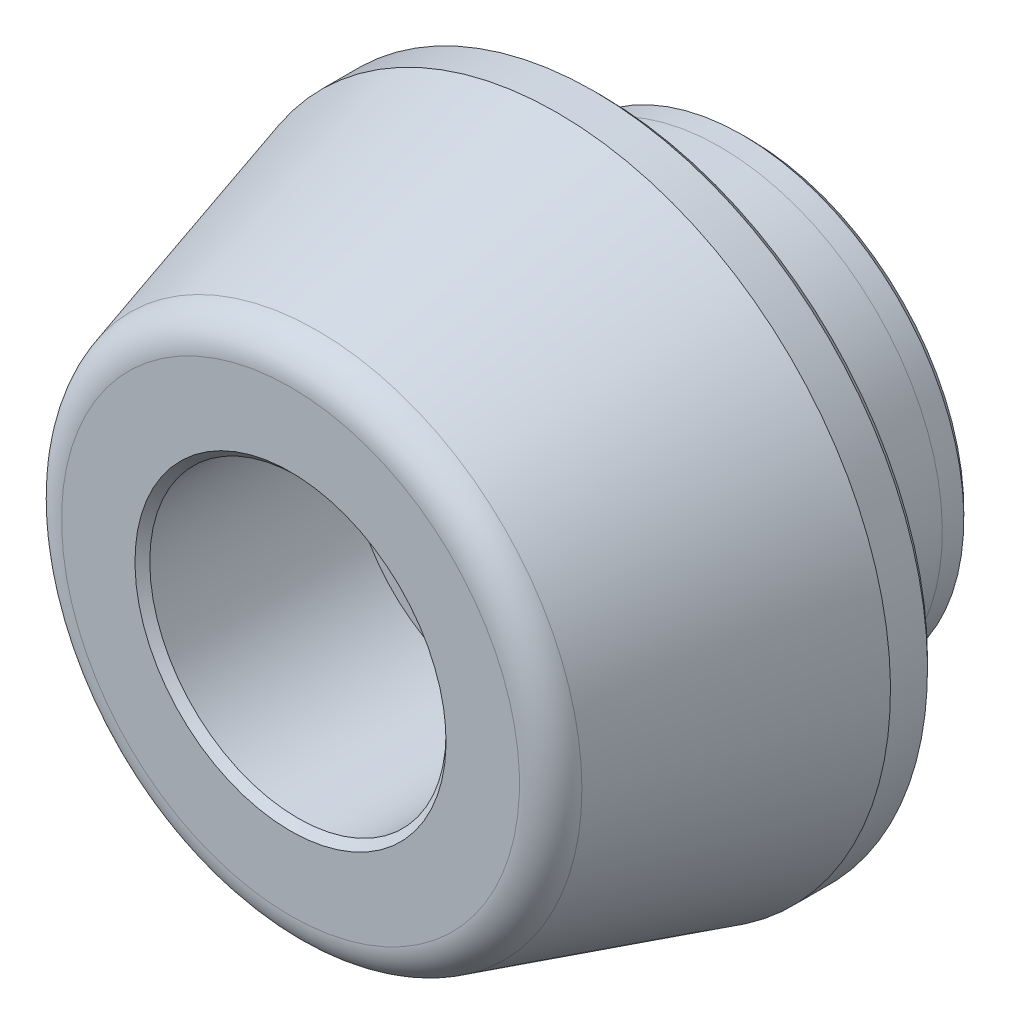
ISO-10303-21;
HEADER;
FILE_DESCRIPTION(('STEP AP214'),'2;1');
FILE_NAME('part.step','',(''),(''),'','','');
FILE_SCHEMA(('AUTOMOTIVE_DESIGN { 1 0 10303 214 1 1 1 1 }'));
ENDSEC;
DATA;
#1=APPLICATION_CONTEXT('core data for automotive mechanical design processes');
#2=APPLICATION_PROTOCOL_DEFINITION('international standard','automotive_design',2000,#1);
#3=PRODUCT_CONTEXT('',#1,'mechanical');
#4=PRODUCT('Part','Part','',(#3));
#5=PRODUCT_RELATED_PRODUCT_CATEGORY('part','',(#4));
#6=PRODUCT_DEFINITION_FORMATION('','',#4);
#7=PRODUCT_DEFINITION_CONTEXT('part definition',#1,'design');
#8=PRODUCT_DEFINITION('design','',#6,#7);
#9=PRODUCT_DEFINITION_SHAPE('','',#8);
#10=(LENGTH_UNIT() NAMED_UNIT(*) SI_UNIT(.MILLI.,.METRE.));
#11=(NAMED_UNIT(*) PLANE_ANGLE_UNIT() SI_UNIT($,.RADIAN.));
#12=(NAMED_UNIT(*) SI_UNIT($,.STERADIAN.) SOLID_ANGLE_UNIT());
#13=UNCERTAINTY_MEASURE_WITH_UNIT(LENGTH_MEASURE(1.E-05),#10,'distance_accuracy_value','');
#14=(GEOMETRIC_REPRESENTATION_CONTEXT(3) GLOBAL_UNCERTAINTY_ASSIGNED_CONTEXT((#13)) GLOBAL_UNIT_ASSIGNED_CONTEXT((#10,
#11,#12)) REPRESENTATION_CONTEXT('',''));
#15=CARTESIAN_POINT('',(0.,0.,0.));
#16=DIRECTION('',(0.,0.,1.));
#17=DIRECTION('',(1.,0.,0.));
#18=AXIS2_PLACEMENT_3D('',#15,#16,#17);
#19=CARTESIAN_POINT('',(0.,-1.08235921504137E-13,31.));
#20=DIRECTION('',(0.,0.,1.));
#21=DIRECTION('',(0.,-1.,0.));
#22=AXIS2_PLACEMENT_3D('',#19,#20,#21);
#23=CYLINDRICAL_SURFACE('',#22,7.);
#24=CARTESIAN_POINT('',(0.,0.,2.));
#25=DIRECTION('',(0.,0.,-1.));
#26=DIRECTION('',(0.,1.,0.));
#27=AXIS2_PLACEMENT_3D('',#24,#25,#26);
#28=CIRCLE('',#27,7.);
#29=CARTESIAN_POINT('',(0.,6.99999999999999,2.00000000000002));
#30=VERTEX_POINT('',#29);
#31=EDGE_CURVE('E9',#30,#30,#28,.T.);
#32=ORIENTED_EDGE('',*,*,#31,.T.);
#33=EDGE_LOOP('',(#32));
#34=FACE_BOUND('',#33,.T.);
#35=CARTESIAN_POINT('',(0.,0.,16.5));
#36=DIRECTION('',(0.,0.,1.));
#37=DIRECTION('',(0.,-1.,0.));
#38=AXIS2_PLACEMENT_3D('',#35,#36,#37);
#39=CIRCLE('',#38,7.);
#40=CARTESIAN_POINT('',(0.,-7.00000000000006,16.5));
#41=VERTEX_POINT('',#40);
#42=EDGE_CURVE('E40',#41,#41,#39,.T.);
#43=ORIENTED_EDGE('',*,*,#42,.T.);
#44=EDGE_LOOP('',(#43));
#45=FACE_BOUND('',#44,.T.);
#46=ADVANCED_FACE('F14',(#34,#45),#23,.F.);
#47=CARTESIAN_POINT('',(0.,0.,0.));
#48=DIRECTION('',(0.,0.,-1.));
#49=DIRECTION('',(0.,1.,0.));
#50=AXIS2_PLACEMENT_3D('',#47,#48,#49);
#51=CYLINDRICAL_SURFACE('',#50,15.);
#52=CARTESIAN_POINT('',(0.,0.,8.8));
#53=DIRECTION('',(0.,0.,-1.));
#54=DIRECTION('',(0.,1.,0.));
#55=AXIS2_PLACEMENT_3D('',#52,#53,#54);
#56=CIRCLE('',#55,15.);
#57=CARTESIAN_POINT('',(0.,15.,8.80000000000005));
#58=VERTEX_POINT('',#57);
#59=EDGE_CURVE('E70',#58,#58,#56,.T.);
#60=ORIENTED_EDGE('',*,*,#59,.T.);
#61=EDGE_LOOP('',(#60));
#62=FACE_BOUND('',#61,.T.);
#63=CARTESIAN_POINT('',(0.,0.,2.));
#64=DIRECTION('',(0.,0.,-1.));
#65=DIRECTION('',(0.,1.,0.));
#66=AXIS2_PLACEMENT_3D('',#63,#64,#65);
#67=CIRCLE('',#66,15.);
#68=CARTESIAN_POINT('',(0.,15.,2.00000000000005));
#69=VERTEX_POINT('',#68);
#70=EDGE_CURVE('E64',#69,#69,#67,.T.);
#71=ORIENTED_EDGE('',*,*,#70,.F.);
#72=EDGE_LOOP('',(#71));
#73=FACE_BOUND('',#72,.T.);
#74=ADVANCED_FACE('F108',(#62,#73),#51,.T.);
#75=CARTESIAN_POINT('',(0.,0.,0.));
#76=DIRECTION('',(0.,0.,-1.));
#77=DIRECTION('',(0.,1.,0.));
#78=AXIS2_PLACEMENT_3D('',#75,#76,#77);
#79=PLANE('',#78);
#80=CARTESIAN_POINT('',(0.,0.,0.));
#81=DIRECTION('',(0.,0.,-1.));
#82=DIRECTION('',(0.,1.,0.));
#83=AXIS2_PLACEMENT_3D('',#80,#81,#82);
#84=CIRCLE('',#83,9.);
#85=CARTESIAN_POINT('',(0.,9.,0.));
#86=VERTEX_POINT('',#85);
#87=EDGE_CURVE('E21',#86,#86,#84,.F.);
#88=ORIENTED_EDGE('',*,*,#87,.T.);
#89=EDGE_LOOP('',(#88));
#90=FACE_BOUND('',#89,.T.);
#91=CARTESIAN_POINT('',(0.,0.,0.));
#92=DIRECTION('',(0.,0.,-1.));
#93=DIRECTION('',(0.,1.,0.));
#94=AXIS2_PLACEMENT_3D('',#91,#92,#93);
#95=CIRCLE('',#94,14.45);
#96=CARTESIAN_POINT('',(0.,14.45,0.));
#97=VERTEX_POINT('',#96);
#98=EDGE_CURVE('E49',#97,#97,#95,.T.);
#99=ORIENTED_EDGE('',*,*,#98,.T.);
#100=EDGE_LOOP('',(#99));
#101=FACE_BOUND('',#100,.T.);
#102=ADVANCED_FACE('F114',(#90,#101),#79,.T.);
#103=CARTESIAN_POINT('',(0.,-1.08235921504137E-13,31.));
#104=DIRECTION('',(0.,0.,1.));
#105=DIRECTION('',(0.,-1.,0.));
#106=AXIS2_PLACEMENT_3D('',#103,#104,#105);
#107=PLANE('',#106);
#108=CARTESIAN_POINT('',(0.,-1.08235921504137E-13,31.));
#109=DIRECTION('',(0.,0.,1.));
#110=DIRECTION('',(0.,-1.,0.));
#111=AXIS2_PLACEMENT_3D('',#108,#109,#110);
#112=CIRCLE('',#111,10.5);
#113=CARTESIAN_POINT('',(0.,-10.5000000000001,31.));
#114=VERTEX_POINT('',#113);
#115=EDGE_CURVE('E34',#114,#114,#112,.F.);
#116=ORIENTED_EDGE('',*,*,#115,.T.);
#117=EDGE_LOOP('',(#116));
#118=FACE_BOUND('',#117,.T.);
#119=CARTESIAN_POINT('',(0.,-1.08235921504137E-13,31.));
#120=DIRECTION('',(0.,0.,1.));
#121=DIRECTION('',(0.,-1.,0.));
#122=AXIS2_PLACEMENT_3D('',#119,#120,#121);
#123=CIRCLE('',#122,15.4546979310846);
#124=CARTESIAN_POINT('',(0.,-15.4546979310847,30.9999999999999));
#125=VERTEX_POINT('',#124);
#126=EDGE_CURVE('E52',#125,#125,#123,.T.);
#127=ORIENTED_EDGE('',*,*,#126,.T.);
#128=EDGE_LOOP('',(#127));
#129=FACE_BOUND('',#128,.T.);
#130=ADVANCED_FACE('F120',(#118,#129),#107,.T.);
#131=CARTESIAN_POINT('',(0.,0.,13.));
#132=DIRECTION('',(0.,0.,-1.));
#133=DIRECTION('',(0.,1.,0.));
#134=AXIS2_PLACEMENT_3D('',#131,#132,#133);
#135=CONICAL_SURFACE('',#134,22.5,0.279252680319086);
#136=CARTESIAN_POINT('',(0.,-1.01913174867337E-13,29.1890933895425));
#137=DIRECTION('',(0.,0.,1.));
#138=DIRECTION('',(0.,-1.,0.));
#139=AXIS2_PLACEMENT_3D('',#136,#137,#138);
#140=CIRCLE('',#139,17.8578521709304);
#141=CARTESIAN_POINT('',(0.,-17.8578521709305,29.1890933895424));
#142=VERTEX_POINT('',#141);
#143=EDGE_CURVE('E55',#142,#142,#140,.F.);
#144=ORIENTED_EDGE('',*,*,#143,.T.);
#145=EDGE_LOOP('',(#144));
#146=FACE_BOUND('',#145,.T.);
#147=CARTESIAN_POINT('',(0.,0.,13.));
#148=DIRECTION('',(0.,0.,-1.));
#149=DIRECTION('',(0.,1.,0.));
#150=AXIS2_PLACEMENT_3D('',#147,#148,#149);
#151=CIRCLE('',#150,22.5);
#152=CARTESIAN_POINT('',(0.,22.5,13.0000000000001));
#153=VERTEX_POINT('',#152);
#154=EDGE_CURVE('E58',#153,#153,#151,.T.);
#155=ORIENTED_EDGE('',*,*,#154,.F.);
#156=EDGE_LOOP('',(#155));
#157=FACE_BOUND('',#156,.T.);
#158=ADVANCED_FACE('F103',(#146,#157),#135,.T.);
#159=CARTESIAN_POINT('',(0.,0.,0.));
#160=DIRECTION('',(0.,0.,-1.));
#161=DIRECTION('',(0.,1.,0.));
#162=AXIS2_PLACEMENT_3D('',#159,#160,#161);
#163=CYLINDRICAL_SURFACE('',#162,22.5);
#164=CARTESIAN_POINT('',(0.,0.,10.5));
#165=DIRECTION('',(0.,0.,-1.));
#166=DIRECTION('',(0.,1.,0.));
#167=AXIS2_PLACEMENT_3D('',#164,#165,#166);
#168=CIRCLE('',#167,22.5);
#169=CARTESIAN_POINT('',(0.,22.5,10.5000000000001));
#170=VERTEX_POINT('',#169);
#171=EDGE_CURVE('E25',#170,#170,#168,.F.);
#172=ORIENTED_EDGE('',*,*,#171,.T.);
#173=EDGE_LOOP('',(#172));
#174=FACE_BOUND('',#173,.T.);
#175=ORIENTED_EDGE('',*,*,#154,.T.);
#176=EDGE_LOOP('',(#175));
#177=FACE_BOUND('',#176,.T.);
#178=ADVANCED_FACE('F91',(#174,#177),#163,.T.);
#179=CARTESIAN_POINT('',(22.5,0.,10.));
#180=DIRECTION('',(0.,0.,-1.));
#181=DIRECTION('',(0.,1.,0.));
#182=AXIS2_PLACEMENT_3D('',#179,#180,#181);
#183=PLANE('',#182);
#184=CARTESIAN_POINT('',(0.,0.,10.));
#185=DIRECTION('',(0.,0.,-1.));
#186=DIRECTION('',(0.,1.,0.));
#187=AXIS2_PLACEMENT_3D('',#184,#185,#186);
#188=CIRCLE('',#187,22.);
#189=CARTESIAN_POINT('',(0.,22.,10.0000000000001));
#190=VERTEX_POINT('',#189);
#191=EDGE_CURVE('E29',#190,#190,#188,.T.);
#192=ORIENTED_EDGE('',*,*,#191,.T.);
#193=EDGE_LOOP('',(#192));
#194=FACE_BOUND('',#193,.T.);
#195=CARTESIAN_POINT('',(0.,0.,10.));
#196=DIRECTION('',(0.,0.,-1.));
#197=DIRECTION('',(0.,1.,0.));
#198=AXIS2_PLACEMENT_3D('',#195,#196,#197);
#199=CIRCLE('',#198,15.8);
#200=CARTESIAN_POINT('',(0.,15.8,10.0000000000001));
#201=VERTEX_POINT('',#200);
#202=EDGE_CURVE('E82',#201,#201,#199,.T.);
#203=ORIENTED_EDGE('',*,*,#202,.F.);
#204=EDGE_LOOP('',(#203));
#205=FACE_BOUND('',#204,.T.);
#206=ADVANCED_FACE('F88',(#194,#205),#183,.T.);
#207=CARTESIAN_POINT('',(0.,0.,0.));
#208=DIRECTION('',(0.,0.,-1.));
#209=DIRECTION('',(0.,1.,0.));
#210=AXIS2_PLACEMENT_3D('',#207,#208,#209);
#211=CYLINDRICAL_SURFACE('',#210,14.95);
#212=CARTESIAN_POINT('',(0.,0.,0.5));
#213=DIRECTION('',(0.,0.,-1.));
#214=DIRECTION('',(0.,1.,0.));
#215=AXIS2_PLACEMENT_3D('',#212,#213,#214);
#216=CIRCLE('',#215,14.95);
#217=CARTESIAN_POINT('',(0.,14.95,0.500000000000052));
#218=VERTEX_POINT('',#217);
#219=EDGE_CURVE('E46',#218,#218,#216,.F.);
#220=ORIENTED_EDGE('',*,*,#219,.T.);
#221=EDGE_LOOP('',(#220));
#222=FACE_BOUND('',#221,.T.);
#223=CARTESIAN_POINT('',(0.,0.,2.));
#224=DIRECTION('',(0.,0.,-1.));
#225=DIRECTION('',(0.,1.,0.));
#226=AXIS2_PLACEMENT_3D('',#223,#224,#225);
#227=CIRCLE('',#226,14.95);
#228=CARTESIAN_POINT('',(0.,14.95,2.00000000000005));
#229=VERTEX_POINT('',#228);
#230=EDGE_CURVE('E61',#229,#229,#227,.T.);
#231=ORIENTED_EDGE('',*,*,#230,.T.);
#232=EDGE_LOOP('',(#231));
#233=FACE_BOUND('',#232,.T.);
#234=ADVANCED_FACE('F90',(#222,#233),#211,.T.);
#235=CARTESIAN_POINT('',(-14.95,0.,2.));
#236=DIRECTION('',(0.,0.,-1.));
#237=DIRECTION('',(0.,1.,0.));
#238=AXIS2_PLACEMENT_3D('',#235,#236,#237);
#239=PLANE('',#238);
#240=ORIENTED_EDGE('',*,*,#70,.T.);
#241=EDGE_LOOP('',(#240));
#242=FACE_BOUND('',#241,.T.);
#243=ORIENTED_EDGE('',*,*,#230,.F.);
#244=EDGE_LOOP('',(#243));
#245=FACE_BOUND('',#244,.T.);
#246=ADVANCED_FACE('F100',(#242,#245),#239,.T.);
#247=CARTESIAN_POINT('',(0.,0.,17.));
#248=DIRECTION('',(0.,0.,1.));
#249=DIRECTION('',(0.,-1.,0.));
#250=AXIS2_PLACEMENT_3D('',#247,#248,#249);
#251=PLANE('',#250);
#252=CARTESIAN_POINT('',(0.,0.,17.));
#253=DIRECTION('',(0.,0.,1.));
#254=DIRECTION('',(0.,-1.,0.));
#255=AXIS2_PLACEMENT_3D('',#252,#253,#254);
#256=CIRCLE('',#255,7.5);
#257=CARTESIAN_POINT('',(0.,-7.50000000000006,17.));
#258=VERTEX_POINT('',#257);
#259=EDGE_CURVE('E43',#258,#258,#256,.F.);
#260=ORIENTED_EDGE('',*,*,#259,.T.);
#261=EDGE_LOOP('',(#260));
#262=FACE_BOUND('',#261,.T.);
#263=CARTESIAN_POINT('',(0.,0.,17.));
#264=DIRECTION('',(0.,0.,1.));
#265=DIRECTION('',(0.,-1.,0.));
#266=AXIS2_PLACEMENT_3D('',#263,#264,#265);
#267=CIRCLE('',#266,10.);
#268=CARTESIAN_POINT('',(0.,-10.0000000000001,17.));
#269=VERTEX_POINT('',#268);
#270=EDGE_CURVE('E67',#269,#269,#267,.T.);
#271=ORIENTED_EDGE('',*,*,#270,.T.);
#272=EDGE_LOOP('',(#271));
#273=FACE_BOUND('',#272,.T.);
#274=ADVANCED_FACE('F186',(#262,#273),#251,.T.);
#275=CARTESIAN_POINT('',(0.,0.,17.));
#276=DIRECTION('',(0.,0.,1.));
#277=DIRECTION('',(0.,-1.,0.));
#278=AXIS2_PLACEMENT_3D('',#275,#276,#277);
#279=CYLINDRICAL_SURFACE('',#278,10.);
#280=CARTESIAN_POINT('',(0.,-1.06490180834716E-13,30.5));
#281=DIRECTION('',(0.,0.,1.));
#282=DIRECTION('',(0.,-1.,0.));
#283=AXIS2_PLACEMENT_3D('',#280,#281,#282);
#284=CIRCLE('',#283,10.);
#285=CARTESIAN_POINT('',(0.,-10.0000000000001,30.5));
#286=VERTEX_POINT('',#285);
#287=EDGE_CURVE('E37',#286,#286,#284,.T.);
#288=ORIENTED_EDGE('',*,*,#287,.T.);
#289=EDGE_LOOP('',(#288));
#290=FACE_BOUND('',#289,.T.);
#291=ORIENTED_EDGE('',*,*,#270,.F.);
#292=EDGE_LOOP('',(#291));
#293=FACE_BOUND('',#292,.T.);
#294=ADVANCED_FACE('F176',(#290,#293),#279,.F.);
#295=CARTESIAN_POINT('',(0.,0.,28.5));
#296=DIRECTION('',(0.,0.,1.));
#297=DIRECTION('',(0.,-1.,0.));
#298=AXIS2_PLACEMENT_3D('',#295,#296,#297);
#299=TOROIDAL_SURFACE('',#298,15.4546979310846,2.5);
#300=ORIENTED_EDGE('',*,*,#126,.F.);
#301=EDGE_LOOP('',(#300));
#302=FACE_BOUND('',#301,.T.);
#303=ORIENTED_EDGE('',*,*,#143,.F.);
#304=EDGE_LOOP('',(#303));
#305=FACE_BOUND('',#304,.T.);
#306=ADVANCED_FACE('F148',(#302,#305),#299,.T.);
#307=CARTESIAN_POINT('',(0.,0.,9.66602540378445));
#308=DIRECTION('',(0.,0.,-1.));
#309=DIRECTION('',(0.,1.,0.));
#310=AXIS2_PLACEMENT_3D('',#307,#308,#309);
#311=CONICAL_SURFACE('',#310,14.5,0.523598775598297);
#312=ORIENTED_EDGE('',*,*,#59,.F.);
#313=EDGE_LOOP('',(#312));
#314=FACE_BOUND('',#313,.T.);
#315=CARTESIAN_POINT('',(0.,0.,9.66602540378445));
#316=DIRECTION('',(0.,0.,-1.));
#317=DIRECTION('',(0.,1.,0.));
#318=AXIS2_PLACEMENT_3D('',#315,#316,#317);
#319=CIRCLE('',#318,14.5);
#320=CARTESIAN_POINT('',(0.,14.5,9.6660254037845));
#321=VERTEX_POINT('',#320);
#322=EDGE_CURVE('E73',#321,#321,#319,.T.);
#323=ORIENTED_EDGE('',*,*,#322,.T.);
#324=EDGE_LOOP('',(#323));
#325=FACE_BOUND('',#324,.T.);
#326=ADVANCED_FACE('F175',(#314,#325),#311,.T.);
#327=CARTESIAN_POINT('',(0.,0.,0.));
#328=DIRECTION('',(0.,0.,-1.));
#329=DIRECTION('',(0.,1.,0.));
#330=AXIS2_PLACEMENT_3D('',#327,#328,#329);
#331=CYLINDRICAL_SURFACE('',#330,14.5);
#332=ORIENTED_EDGE('',*,*,#322,.F.);
#333=EDGE_LOOP('',(#332));
#334=FACE_BOUND('',#333,.T.);
#335=CARTESIAN_POINT('',(0.,0.,10.1));
#336=DIRECTION('',(0.,0.,-1.));
#337=DIRECTION('',(0.,1.,0.));
#338=AXIS2_PLACEMENT_3D('',#335,#336,#337);
#339=CIRCLE('',#338,14.5);
#340=CARTESIAN_POINT('',(0.,14.5,10.1));
#341=VERTEX_POINT('',#340);
#342=EDGE_CURVE('E76',#341,#341,#339,.T.);
#343=ORIENTED_EDGE('',*,*,#342,.T.);
#344=EDGE_LOOP('',(#343));
#345=FACE_BOUND('',#344,.T.);
#346=ADVANCED_FACE('F183',(#334,#345),#331,.T.);
#347=CARTESIAN_POINT('',(0.,0.,10.1));
#348=DIRECTION('',(0.,0.,-1.));
#349=DIRECTION('',(0.,1.,0.));
#350=AXIS2_PLACEMENT_3D('',#347,#348,#349);
#351=TOROIDAL_SURFACE('',#350,14.9,0.4);
#352=ORIENTED_EDGE('',*,*,#342,.F.);
#353=EDGE_LOOP('',(#352));
#354=FACE_BOUND('',#353,.T.);
#355=CARTESIAN_POINT('',(0.,0.,10.4371529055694));
#356=DIRECTION('',(0.,0.,-1.));
#357=DIRECTION('',(0.,1.,0.));
#358=AXIS2_PLACEMENT_3D('',#355,#356,#357);
#359=CIRCLE('',#358,15.1152392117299);
#360=CARTESIAN_POINT('',(0.,15.1152392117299,10.4371529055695));
#361=VERTEX_POINT('',#360);
#362=EDGE_CURVE('E79',#361,#361,#359,.T.);
#363=ORIENTED_EDGE('',*,*,#362,.T.);
#364=EDGE_LOOP('',(#363));
#365=FACE_BOUND('',#364,.T.);
#366=ADVANCED_FACE('F143',(#354,#365),#351,.F.);
#367=CARTESIAN_POINT('',(0.,0.,10.));
#368=DIRECTION('',(0.,0.,-1.));
#369=DIRECTION('',(0.,1.,0.));
#370=AXIS2_PLACEMENT_3D('',#367,#368,#369);
#371=CONICAL_SURFACE('',#370,15.8,1.00261735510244);
#372=ORIENTED_EDGE('',*,*,#362,.F.);
#373=EDGE_LOOP('',(#372));
#374=FACE_BOUND('',#373,.T.);
#375=ORIENTED_EDGE('',*,*,#202,.T.);
#376=EDGE_LOOP('',(#375));
#377=FACE_BOUND('',#376,.T.);
#378=ADVANCED_FACE('F86',(#374,#377),#371,.F.);
#379=CARTESIAN_POINT('',(0.,0.,0.));
#380=DIRECTION('',(0.,0.,1.));
#381=DIRECTION('',(0.,-1.,0.));
#382=AXIS2_PLACEMENT_3D('',#379,#380,#381);
#383=CONICAL_SURFACE('',#382,14.45,0.785398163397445);
#384=ORIENTED_EDGE('',*,*,#219,.F.);
#385=EDGE_LOOP('',(#384));
#386=FACE_BOUND('',#385,.T.);
#387=ORIENTED_EDGE('',*,*,#98,.F.);
#388=EDGE_LOOP('',(#387));
#389=FACE_BOUND('',#388,.T.);
#390=ADVANCED_FACE('F130',(#386,#389),#383,.T.);
#391=CARTESIAN_POINT('',(0.,0.,17.));
#392=DIRECTION('',(0.,0.,1.));
#393=DIRECTION('',(0.,-1.,0.));
#394=AXIS2_PLACEMENT_3D('',#391,#392,#393);
#395=CONICAL_SURFACE('',#394,7.5,0.78539816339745);
#396=ORIENTED_EDGE('',*,*,#42,.F.);
#397=EDGE_LOOP('',(#396));
#398=FACE_BOUND('',#397,.T.);
#399=ORIENTED_EDGE('',*,*,#259,.F.);
#400=EDGE_LOOP('',(#399));
#401=FACE_BOUND('',#400,.T.);
#402=ADVANCED_FACE('F132',(#398,#401),#395,.F.);
#403=CARTESIAN_POINT('',(0.,-1.06490180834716E-13,30.5));
#404=DIRECTION('',(0.,0.,1.));
#405=DIRECTION('',(0.,-1.,0.));
#406=AXIS2_PLACEMENT_3D('',#403,#404,#405);
#407=CONICAL_SURFACE('',#406,10.,0.785398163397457);
#408=ORIENTED_EDGE('',*,*,#115,.F.);
#409=EDGE_LOOP('',(#408));
#410=FACE_BOUND('',#409,.T.);
#411=ORIENTED_EDGE('',*,*,#287,.F.);
#412=EDGE_LOOP('',(#411));
#413=FACE_BOUND('',#412,.T.);
#414=ADVANCED_FACE('F140',(#410,#413),#407,.F.);
#415=CARTESIAN_POINT('',(0.,0.,10.));
#416=DIRECTION('',(0.,0.,1.));
#417=DIRECTION('',(0.,-1.,0.));
#418=AXIS2_PLACEMENT_3D('',#415,#416,#417);
#419=CONICAL_SURFACE('',#418,22.,0.785398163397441);
#420=ORIENTED_EDGE('',*,*,#171,.F.);
#421=EDGE_LOOP('',(#420));
#422=FACE_BOUND('',#421,.T.);
#423=ORIENTED_EDGE('',*,*,#191,.F.);
#424=EDGE_LOOP('',(#423));
#425=FACE_BOUND('',#424,.T.);
#426=ADVANCED_FACE('F151',(#422,#425),#419,.T.);
#427=CARTESIAN_POINT('',(0.,0.,0.));
#428=DIRECTION('',(0.,0.,-1.));
#429=DIRECTION('',(0.,1.,0.));
#430=AXIS2_PLACEMENT_3D('',#427,#428,#429);
#431=CONICAL_SURFACE('',#430,9.,0.785398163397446);
#432=ORIENTED_EDGE('',*,*,#31,.F.);
#433=EDGE_LOOP('',(#432));
#434=FACE_BOUND('',#433,.T.);
#435=ORIENTED_EDGE('',*,*,#87,.F.);
#436=EDGE_LOOP('',(#435));
#437=FACE_BOUND('',#436,.T.);
#438=ADVANCED_FACE('F16',(#434,#437),#431,.F.);
#439=CLOSED_SHELL('',(#46,#74,#102,#130,#158,#178,#206,#234,#246,#274,#294,#306,#326,#346,#366,
#378,#390,#402,#414,#426,#438));
#440=MANIFOLD_SOLID_BREP('B1',#439);
#441=ADVANCED_BREP_SHAPE_REPRESENTATION('',(#18,#440),#14);
#442=SHAPE_DEFINITION_REPRESENTATION(#9,#441);
ENDSEC;
END-ISO-10303-21;
